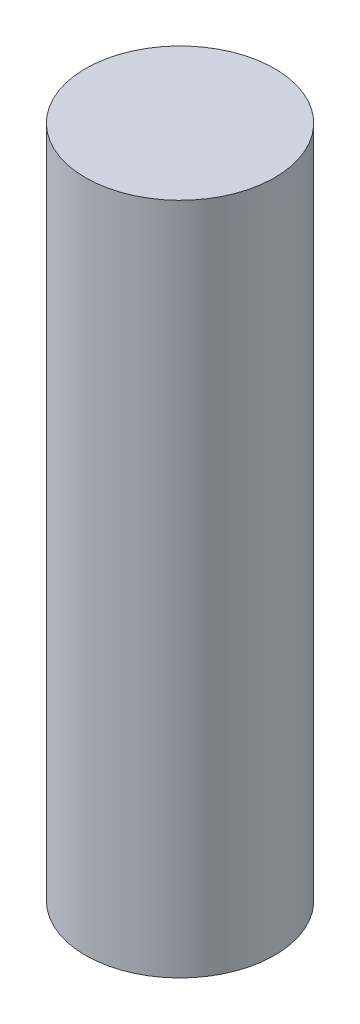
ISO-10303-21;
HEADER;
FILE_DESCRIPTION(('STEP AP214'),'2;1');
FILE_NAME('part.step','',(''),(''),'','','');
FILE_SCHEMA(('AUTOMOTIVE_DESIGN { 1 0 10303 214 1 1 1 1 }'));
ENDSEC;
DATA;
#1=APPLICATION_CONTEXT('core data for automotive mechanical design processes');
#2=APPLICATION_PROTOCOL_DEFINITION('international standard','automotive_design',2000,#1);
#3=PRODUCT_CONTEXT('',#1,'mechanical');
#4=PRODUCT('Part','Part','',(#3));
#5=PRODUCT_RELATED_PRODUCT_CATEGORY('part','',(#4));
#6=PRODUCT_DEFINITION_FORMATION('','',#4);
#7=PRODUCT_DEFINITION_CONTEXT('part definition',#1,'design');
#8=PRODUCT_DEFINITION('design','',#6,#7);
#9=PRODUCT_DEFINITION_SHAPE('','',#8);
#10=(LENGTH_UNIT() NAMED_UNIT(*) SI_UNIT(.MILLI.,.METRE.));
#11=(NAMED_UNIT(*) PLANE_ANGLE_UNIT() SI_UNIT($,.RADIAN.));
#12=(NAMED_UNIT(*) SI_UNIT($,.STERADIAN.) SOLID_ANGLE_UNIT());
#13=UNCERTAINTY_MEASURE_WITH_UNIT(LENGTH_MEASURE(1.E-05),#10,'distance_accuracy_value','');
#14=(GEOMETRIC_REPRESENTATION_CONTEXT(3) GLOBAL_UNCERTAINTY_ASSIGNED_CONTEXT((#13)) GLOBAL_UNIT_ASSIGNED_CONTEXT((#10,
#11,#12)) REPRESENTATION_CONTEXT('',''));
#15=CARTESIAN_POINT('',(0.,0.,0.));
#16=DIRECTION('',(0.,0.,1.));
#17=DIRECTION('',(1.,0.,0.));
#18=AXIS2_PLACEMENT_3D('',#15,#16,#17);
#19=CARTESIAN_POINT('',(0.,65.,0.));
#20=DIRECTION('',(0.,-1.,0.));
#21=DIRECTION('',(0.,0.,-1.));
#22=AXIS2_PLACEMENT_3D('',#19,#20,#21);
#23=CYLINDRICAL_SURFACE('',#22,9.125);
#24=CARTESIAN_POINT('',(0.,65.,0.));
#25=DIRECTION('',(0.,1.,0.));
#26=DIRECTION('',(0.,0.,1.));
#27=AXIS2_PLACEMENT_3D('',#24,#25,#26);
#28=CIRCLE('',#27,9.125);
#29=CARTESIAN_POINT('',(0.,65.,9.125));
#30=VERTEX_POINT('',#29);
#31=EDGE_CURVE('E10',#30,#30,#28,.T.);
#32=ORIENTED_EDGE('',*,*,#31,.F.);
#33=EDGE_LOOP('',(#32));
#34=FACE_BOUND('',#33,.T.);
#35=CARTESIAN_POINT('',(0.,0.,0.));
#36=DIRECTION('',(0.,1.,0.));
#37=DIRECTION('',(0.,0.,1.));
#38=AXIS2_PLACEMENT_3D('',#35,#36,#37);
#39=CIRCLE('',#38,9.125);
#40=CARTESIAN_POINT('',(0.,0.,9.125));
#41=VERTEX_POINT('',#40);
#42=EDGE_CURVE('E33',#41,#41,#39,.T.);
#43=ORIENTED_EDGE('',*,*,#42,.T.);
#44=EDGE_LOOP('',(#43));
#45=FACE_BOUND('',#44,.T.);
#46=ADVANCED_FACE('F30',(#34,#45),#23,.T.);
#47=CARTESIAN_POINT('',(0.,65.,0.));
#48=DIRECTION('',(0.,1.,0.));
#49=DIRECTION('',(0.,0.,1.));
#50=AXIS2_PLACEMENT_3D('',#47,#48,#49);
#51=PLANE('',#50);
#52=ORIENTED_EDGE('',*,*,#31,.T.);
#53=EDGE_LOOP('',(#52));
#54=FACE_BOUND('',#53,.T.);
#55=ADVANCED_FACE('F45',(#54),#51,.T.);
#56=CARTESIAN_POINT('',(0.,0.,0.));
#57=DIRECTION('',(0.,1.,0.));
#58=DIRECTION('',(0.,0.,1.));
#59=AXIS2_PLACEMENT_3D('',#56,#57,#58);
#60=PLANE('',#59);
#61=ORIENTED_EDGE('',*,*,#42,.F.);
#62=EDGE_LOOP('',(#61));
#63=FACE_BOUND('',#62,.T.);
#64=ADVANCED_FACE('F43',(#63),#60,.F.);
#65=CLOSED_SHELL('',(#46,#55,#64));
#66=MANIFOLD_SOLID_BREP('B2',#65);
#67=ADVANCED_BREP_SHAPE_REPRESENTATION('',(#18,#66),#14);
#68=SHAPE_DEFINITION_REPRESENTATION(#9,#67);
ENDSEC;
END-ISO-10303-21;
